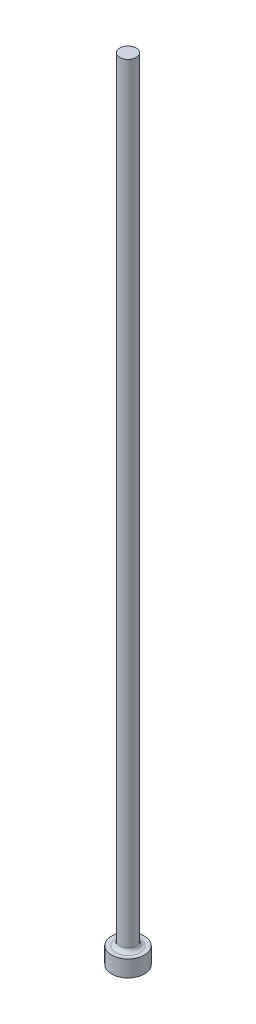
from build123d import *


with BuildPart() as part:
    # Sketch1 → Revolve1 (revolve)
    with BuildSketch(Plane.XY, mode=Mode.PRIVATE) as revolve1_sk:
        with BuildLine():
            Line((0, 0), (3.175, 0))
            Line((3.175, 0), (3.175, 3.175))
            Line((3.175, 3.175), (2.3495, 3.175))
            ThreePointArc((2.3495, 3.175), (1.810684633, 3.398184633), (1.5875, 3.937))
            Line((1.5875, 3.937), (1.5875, 152.4))
            Line((1.5875, 152.4), (0, 152.4))
            Line((0, 152.4), (0, 0))
        make_face()
    revolve(revolve1_sk.sketch.rotate(Axis((0, 152.4, 0), (0, -1, 0)), 180), axis=Axis((0, 152.4, 0), (0, -1, 0)))


solid = part.part
